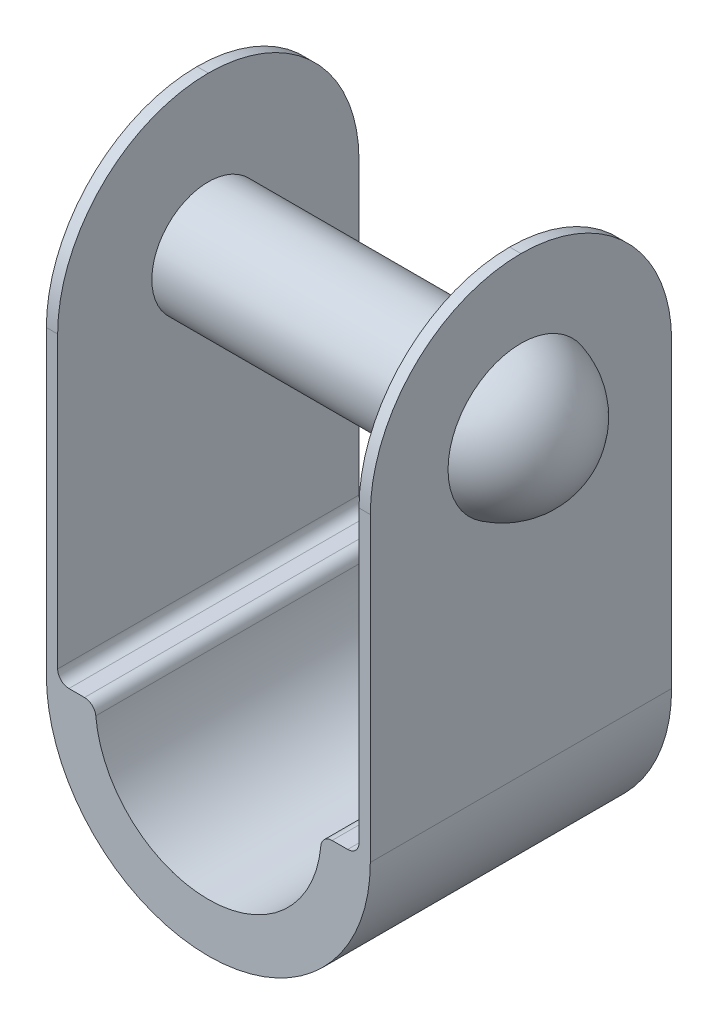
ISO-10303-21;
HEADER;
FILE_DESCRIPTION(('STEP AP214'),'2;1');
FILE_NAME('part.step','',(''),(''),'','','');
FILE_SCHEMA(('AUTOMOTIVE_DESIGN { 1 0 10303 214 1 1 1 1 }'));
ENDSEC;
DATA;
#1=APPLICATION_CONTEXT('core data for automotive mechanical design processes');
#2=APPLICATION_PROTOCOL_DEFINITION('international standard','automotive_design',2000,#1);
#3=PRODUCT_CONTEXT('',#1,'mechanical');
#4=PRODUCT('Part','Part','',(#3));
#5=PRODUCT_RELATED_PRODUCT_CATEGORY('part','',(#4));
#6=PRODUCT_DEFINITION_FORMATION('','',#4);
#7=PRODUCT_DEFINITION_CONTEXT('part definition',#1,'design');
#8=PRODUCT_DEFINITION('design','',#6,#7);
#9=PRODUCT_DEFINITION_SHAPE('','',#8);
#10=(LENGTH_UNIT() NAMED_UNIT(*) SI_UNIT(.MILLI.,.METRE.));
#11=(NAMED_UNIT(*) PLANE_ANGLE_UNIT() SI_UNIT($,.RADIAN.));
#12=(NAMED_UNIT(*) SI_UNIT($,.STERADIAN.) SOLID_ANGLE_UNIT());
#13=UNCERTAINTY_MEASURE_WITH_UNIT(LENGTH_MEASURE(1.E-05),#10,'distance_accuracy_value','');
#14=(GEOMETRIC_REPRESENTATION_CONTEXT(3) GLOBAL_UNCERTAINTY_ASSIGNED_CONTEXT((#13)) GLOBAL_UNIT_ASSIGNED_CONTEXT((#10,
#11,#12)) REPRESENTATION_CONTEXT('',''));
#15=CARTESIAN_POINT('',(0.,0.,0.));
#16=DIRECTION('',(0.,0.,1.));
#17=DIRECTION('',(1.,0.,0.));
#18=AXIS2_PLACEMENT_3D('',#15,#16,#17);
#19=CARTESIAN_POINT('',(-43.,0.,40.));
#20=DIRECTION('',(1.,0.,0.));
#21=DIRECTION('',(0.,0.,-1.));
#22=AXIS2_PLACEMENT_3D('',#19,#20,#21);
#23=PLANE('',#22);
#24=CARTESIAN_POINT('',(-43.,80.,0.));
#25=DIRECTION('',(1.,0.,0.));
#26=DIRECTION('',(0.,0.,-1.));
#27=AXIS2_PLACEMENT_3D('',#24,#25,#26);
#28=CIRCLE('',#27,40.);
#29=CARTESIAN_POINT('',(-43.,80.,40.));
#30=VERTEX_POINT('',#29);
#31=CARTESIAN_POINT('',(-43.,120.,0.));
#32=VERTEX_POINT('',#31);
#33=EDGE_CURVE('E169',#30,#32,#28,.F.);
#34=ORIENTED_EDGE('',*,*,#33,.T.);
#35=CARTESIAN_POINT('',(-43.,80.,0.));
#36=DIRECTION('',(1.,0.,0.));
#37=DIRECTION('',(0.,0.,-1.));
#38=AXIS2_PLACEMENT_3D('',#35,#36,#37);
#39=CIRCLE('',#38,40.);
#40=CARTESIAN_POINT('',(-43.,80.,-40.));
#41=VERTEX_POINT('',#40);
#42=EDGE_CURVE('E197',#32,#41,#39,.F.);
#43=ORIENTED_EDGE('',*,*,#42,.T.);
#44=DIRECTION('',(0.,-1.,0.));
#45=VECTOR('',#44,1.);
#46=CARTESIAN_POINT('',(-43.,0.,-40.));
#47=LINE('',#46,#45);
#48=CARTESIAN_POINT('',(-43.,0.,-40.));
#49=VERTEX_POINT('',#48);
#50=EDGE_CURVE('E166',#41,#49,#47,.T.);
#51=ORIENTED_EDGE('',*,*,#50,.T.);
#52=DIRECTION('',(0.,0.,-1.));
#53=VECTOR('',#52,1.);
#54=CARTESIAN_POINT('',(-43.,0.,40.));
#55=LINE('',#54,#53);
#56=CARTESIAN_POINT('',(-43.,0.,40.));
#57=VERTEX_POINT('',#56);
#58=EDGE_CURVE('E163',#57,#49,#55,.T.);
#59=ORIENTED_EDGE('',*,*,#58,.F.);
#60=DIRECTION('',(0.,-1.,0.));
#61=VECTOR('',#60,1.);
#62=CARTESIAN_POINT('',(-43.,0.,40.));
#63=LINE('',#62,#61);
#64=EDGE_CURVE('E148',#30,#57,#63,.T.);
#65=ORIENTED_EDGE('',*,*,#64,.F.);
#66=EDGE_LOOP('',(#34,#43,#51,#59,#65));
#67=FACE_BOUND('',#66,.T.);
#68=CARTESIAN_POINT('',(-43.,80.,0.));
#69=DIRECTION('',(1.,0.,0.));
#70=DIRECTION('',(0.,0.,-1.));
#71=AXIS2_PLACEMENT_3D('',#68,#69,#70);
#72=CIRCLE('',#71,19.3649167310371);
#73=CARTESIAN_POINT('',(-43.,80.,-19.3649167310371));
#74=VERTEX_POINT('',#73);
#75=EDGE_CURVE('E11',#74,#74,#72,.F.);
#76=ORIENTED_EDGE('',*,*,#75,.F.);
#77=EDGE_LOOP('',(#76));
#78=FACE_BOUND('',#77,.T.);
#79=ADVANCED_FACE('F35',(#67,#78),#23,.F.);
#80=CARTESIAN_POINT('',(43.,0.,40.));
#81=DIRECTION('',(-1.,0.,0.));
#82=DIRECTION('',(0.,0.,1.));
#83=AXIS2_PLACEMENT_3D('',#80,#81,#82);
#84=PLANE('',#83);
#85=DIRECTION('',(0.,1.,0.));
#86=VECTOR('',#85,1.);
#87=CARTESIAN_POINT('',(43.,0.,-40.));
#88=LINE('',#87,#86);
#89=CARTESIAN_POINT('',(43.,0.,-40.));
#90=VERTEX_POINT('',#89);
#91=CARTESIAN_POINT('',(43.,80.,-40.));
#92=VERTEX_POINT('',#91);
#93=EDGE_CURVE('E189',#90,#92,#88,.T.);
#94=ORIENTED_EDGE('',*,*,#93,.T.);
#95=CARTESIAN_POINT('',(43.,80.,0.));
#96=DIRECTION('',(-1.,0.,0.));
#97=DIRECTION('',(0.,0.,1.));
#98=AXIS2_PLACEMENT_3D('',#95,#96,#97);
#99=CIRCLE('',#98,40.);
#100=CARTESIAN_POINT('',(43.,120.,0.));
#101=VERTEX_POINT('',#100);
#102=EDGE_CURVE('E216',#92,#101,#99,.F.);
#103=ORIENTED_EDGE('',*,*,#102,.T.);
#104=CARTESIAN_POINT('',(43.,80.,0.));
#105=DIRECTION('',(-1.,0.,0.));
#106=DIRECTION('',(0.,0.,1.));
#107=AXIS2_PLACEMENT_3D('',#104,#105,#106);
#108=CIRCLE('',#107,40.);
#109=CARTESIAN_POINT('',(43.,80.,40.));
#110=VERTEX_POINT('',#109);
#111=EDGE_CURVE('E214',#101,#110,#108,.F.);
#112=ORIENTED_EDGE('',*,*,#111,.T.);
#113=DIRECTION('',(0.,1.,0.));
#114=VECTOR('',#113,1.);
#115=CARTESIAN_POINT('',(43.,0.,40.));
#116=LINE('',#115,#114);
#117=CARTESIAN_POINT('',(43.,0.,40.));
#118=VERTEX_POINT('',#117);
#119=EDGE_CURVE('E175',#118,#110,#116,.T.);
#120=ORIENTED_EDGE('',*,*,#119,.F.);
#121=DIRECTION('',(0.,0.,-1.));
#122=VECTOR('',#121,1.);
#123=CARTESIAN_POINT('',(43.,0.,40.));
#124=LINE('',#123,#122);
#125=EDGE_CURVE('E170',#118,#90,#124,.T.);
#126=ORIENTED_EDGE('',*,*,#125,.T.);
#127=EDGE_LOOP('',(#94,#103,#112,#120,#126));
#128=FACE_BOUND('',#127,.T.);
#129=CARTESIAN_POINT('',(43.,80.,0.));
#130=DIRECTION('',(-1.,0.,0.));
#131=DIRECTION('',(0.,0.,1.));
#132=AXIS2_PLACEMENT_3D('',#129,#130,#131);
#133=CIRCLE('',#132,19.3649167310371);
#134=CARTESIAN_POINT('',(43.,80.,19.3649167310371));
#135=VERTEX_POINT('',#134);
#136=EDGE_CURVE('E43',#135,#135,#133,.F.);
#137=ORIENTED_EDGE('',*,*,#136,.F.);
#138=EDGE_LOOP('',(#137));
#139=FACE_BOUND('',#138,.T.);
#140=ADVANCED_FACE('F265',(#128,#139),#84,.F.);
#141=CARTESIAN_POINT('',(0.,0.,40.));
#142=DIRECTION('',(0.,0.,-1.));
#143=DIRECTION('',(-1.,0.,0.));
#144=AXIS2_PLACEMENT_3D('',#141,#142,#143);
#145=CYLINDRICAL_SURFACE('',#144,43.);
#146=CARTESIAN_POINT('',(0.,0.,-40.));
#147=DIRECTION('',(0.,0.,1.));
#148=DIRECTION('',(1.,0.,0.));
#149=AXIS2_PLACEMENT_3D('',#146,#147,#148);
#150=CIRCLE('',#149,43.);
#151=EDGE_CURVE('E186',#49,#90,#150,.T.);
#152=ORIENTED_EDGE('',*,*,#151,.T.);
#153=ORIENTED_EDGE('',*,*,#125,.F.);
#154=CARTESIAN_POINT('',(0.,0.,40.));
#155=DIRECTION('',(0.,0.,1.));
#156=DIRECTION('',(1.,0.,0.));
#157=AXIS2_PLACEMENT_3D('',#154,#155,#156);
#158=CIRCLE('',#157,43.);
#159=EDGE_CURVE('E154',#57,#118,#158,.T.);
#160=ORIENTED_EDGE('',*,*,#159,.F.);
#161=ORIENTED_EDGE('',*,*,#58,.T.);
#162=EDGE_LOOP('',(#152,#153,#160,#161));
#163=FACE_BOUND('',#162,.T.);
#164=ADVANCED_FACE('F172',(#163),#145,.T.);
#165=CARTESIAN_POINT('',(40.,120.,40.));
#166=DIRECTION('',(1.,0.,0.));
#167=DIRECTION('',(0.,1.,0.));
#168=AXIS2_PLACEMENT_3D('',#165,#166,#167);
#169=PLANE('',#168);
#170=CARTESIAN_POINT('',(40.,80.,0.));
#171=DIRECTION('',(1.,0.,0.));
#172=DIRECTION('',(0.,1.,0.));
#173=AXIS2_PLACEMENT_3D('',#170,#171,#172);
#174=CIRCLE('',#173,15.);
#175=CARTESIAN_POINT('',(40.,95.,0.));
#176=VERTEX_POINT('',#175);
#177=EDGE_CURVE('E322',#176,#176,#174,.F.);
#178=ORIENTED_EDGE('',*,*,#177,.F.);
#179=EDGE_LOOP('',(#178));
#180=FACE_BOUND('',#179,.T.);
#181=DIRECTION('',(0.,-1.,0.));
#182=VECTOR('',#181,1.);
#183=CARTESIAN_POINT('',(40.,120.,-40.));
#184=LINE('',#183,#182);
#185=CARTESIAN_POINT('',(40.,80.,-40.));
#186=VERTEX_POINT('',#185);
#187=CARTESIAN_POINT('',(40.,3.,-40.));
#188=VERTEX_POINT('',#187);
#189=EDGE_CURVE('E192',#186,#188,#184,.T.);
#190=ORIENTED_EDGE('',*,*,#189,.T.);
#191=DIRECTION('',(0.,0.,-1.));
#192=VECTOR('',#191,1.);
#193=CARTESIAN_POINT('',(40.,3.,40.));
#194=LINE('',#193,#192);
#195=CARTESIAN_POINT('',(40.,3.,40.));
#196=VERTEX_POINT('',#195);
#197=EDGE_CURVE('E252',#188,#196,#194,.F.);
#198=ORIENTED_EDGE('',*,*,#197,.T.);
#199=DIRECTION('',(0.,-1.,0.));
#200=VECTOR('',#199,1.);
#201=CARTESIAN_POINT('',(40.,120.,40.));
#202=LINE('',#201,#200);
#203=CARTESIAN_POINT('',(40.,80.,40.));
#204=VERTEX_POINT('',#203);
#205=EDGE_CURVE('E177',#204,#196,#202,.T.);
#206=ORIENTED_EDGE('',*,*,#205,.F.);
#207=CARTESIAN_POINT('',(40.,80.,0.));
#208=DIRECTION('',(1.,0.,0.));
#209=DIRECTION('',(0.,1.,0.));
#210=AXIS2_PLACEMENT_3D('',#207,#208,#209);
#211=CIRCLE('',#210,40.);
#212=CARTESIAN_POINT('',(40.,120.,0.));
#213=VERTEX_POINT('',#212);
#214=EDGE_CURVE('E210',#204,#213,#211,.F.);
#215=ORIENTED_EDGE('',*,*,#214,.T.);
#216=CARTESIAN_POINT('',(40.,80.,0.));
#217=DIRECTION('',(1.,0.,0.));
#218=DIRECTION('',(0.,1.,0.));
#219=AXIS2_PLACEMENT_3D('',#216,#217,#218);
#220=CIRCLE('',#219,40.);
#221=EDGE_CURVE('E212',#213,#186,#220,.F.);
#222=ORIENTED_EDGE('',*,*,#221,.T.);
#223=EDGE_LOOP('',(#190,#198,#206,#215,#222));
#224=FACE_BOUND('',#223,.T.);
#225=ADVANCED_FACE('F274',(#180,#224),#169,.F.);
#226=CARTESIAN_POINT('',(-40.,120.,40.));
#227=DIRECTION('',(-1.,0.,0.));
#228=DIRECTION('',(0.,-1.,0.));
#229=AXIS2_PLACEMENT_3D('',#226,#227,#228);
#230=PLANE('',#229);
#231=CARTESIAN_POINT('',(-40.,80.,0.));
#232=DIRECTION('',(-1.,0.,0.));
#233=DIRECTION('',(0.,-1.,0.));
#234=AXIS2_PLACEMENT_3D('',#231,#232,#233);
#235=CIRCLE('',#234,15.);
#236=CARTESIAN_POINT('',(-40.,65.,0.));
#237=VERTEX_POINT('',#236);
#238=EDGE_CURVE('E327',#237,#237,#235,.F.);
#239=ORIENTED_EDGE('',*,*,#238,.F.);
#240=EDGE_LOOP('',(#239));
#241=FACE_BOUND('',#240,.T.);
#242=DIRECTION('',(0.,1.,0.));
#243=VECTOR('',#242,1.);
#244=CARTESIAN_POINT('',(-40.,120.,40.));
#245=LINE('',#244,#243);
#246=CARTESIAN_POINT('',(-40.,3.,40.));
#247=VERTEX_POINT('',#246);
#248=CARTESIAN_POINT('',(-40.,80.,40.));
#249=VERTEX_POINT('',#248);
#250=EDGE_CURVE('E183',#247,#249,#245,.T.);
#251=ORIENTED_EDGE('',*,*,#250,.F.);
#252=DIRECTION('',(0.,0.,-1.));
#253=VECTOR('',#252,1.);
#254=CARTESIAN_POINT('',(-40.,3.,40.));
#255=LINE('',#254,#253);
#256=CARTESIAN_POINT('',(-40.,3.,-40.));
#257=VERTEX_POINT('',#256);
#258=EDGE_CURVE('E221',#247,#257,#255,.T.);
#259=ORIENTED_EDGE('',*,*,#258,.T.);
#260=DIRECTION('',(0.,1.,0.));
#261=VECTOR('',#260,1.);
#262=CARTESIAN_POINT('',(-40.,120.,-40.));
#263=LINE('',#262,#261);
#264=CARTESIAN_POINT('',(-40.,80.,-40.));
#265=VERTEX_POINT('',#264);
#266=EDGE_CURVE('E160',#257,#265,#263,.T.);
#267=ORIENTED_EDGE('',*,*,#266,.T.);
#268=CARTESIAN_POINT('',(-40.,80.,0.));
#269=DIRECTION('',(-1.,0.,0.));
#270=DIRECTION('',(0.,-1.,0.));
#271=AXIS2_PLACEMENT_3D('',#268,#269,#270);
#272=CIRCLE('',#271,40.);
#273=CARTESIAN_POINT('',(-40.,120.,0.));
#274=VERTEX_POINT('',#273);
#275=EDGE_CURVE('E208',#265,#274,#272,.F.);
#276=ORIENTED_EDGE('',*,*,#275,.T.);
#277=CARTESIAN_POINT('',(-40.,80.,0.));
#278=DIRECTION('',(-1.,0.,0.));
#279=DIRECTION('',(0.,-1.,0.));
#280=AXIS2_PLACEMENT_3D('',#277,#278,#279);
#281=CIRCLE('',#280,40.);
#282=EDGE_CURVE('E205',#274,#249,#281,.F.);
#283=ORIENTED_EDGE('',*,*,#282,.T.);
#284=EDGE_LOOP('',(#251,#259,#267,#276,#283));
#285=FACE_BOUND('',#284,.T.);
#286=ADVANCED_FACE('F347',(#241,#285),#230,.F.);
#287=CARTESIAN_POINT('',(0.,0.,40.));
#288=DIRECTION('',(0.,0.,1.));
#289=DIRECTION('',(1.,0.,0.));
#290=AXIS2_PLACEMENT_3D('',#287,#288,#289);
#291=PLANE('',#290);
#292=CARTESIAN_POINT('',(0.,0.,40.));
#293=DIRECTION('',(0.,0.,-1.));
#294=DIRECTION('',(1.,0.,0.));
#295=AXIS2_PLACEMENT_3D('',#292,#293,#294);
#296=CIRCLE('',#295,30.);
#297=CARTESIAN_POINT('',(29.8757758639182,-2.72727272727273,40.));
#298=VERTEX_POINT('',#297);
#299=CARTESIAN_POINT('',(-29.8757758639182,-2.72727272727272,40.));
#300=VERTEX_POINT('',#299);
#301=EDGE_CURVE('E321',#298,#300,#296,.T.);
#302=ORIENTED_EDGE('',*,*,#301,.T.);
#303=CARTESIAN_POINT('',(-32.86335345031,-3.,40.));
#304=DIRECTION('',(0.,0.,1.));
#305=DIRECTION('',(1.,0.,0.));
#306=AXIS2_PLACEMENT_3D('',#303,#304,#305);
#307=CIRCLE('',#306,3.);
#308=CARTESIAN_POINT('',(-32.86335345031,0.,40.));
#309=VERTEX_POINT('',#308);
#310=EDGE_CURVE('E241',#300,#309,#307,.T.);
#311=ORIENTED_EDGE('',*,*,#310,.T.);
#312=DIRECTION('',(-1.,0.,0.));
#313=VECTOR('',#312,1.);
#314=CARTESIAN_POINT('',(-30.,0.,40.));
#315=LINE('',#314,#313);
#316=CARTESIAN_POINT('',(-37.,0.,40.));
#317=VERTEX_POINT('',#316);
#318=EDGE_CURVE('E324',#309,#317,#315,.T.);
#319=ORIENTED_EDGE('',*,*,#318,.T.);
#320=CARTESIAN_POINT('',(-37.,3.,40.));
#321=DIRECTION('',(0.,0.,1.));
#322=DIRECTION('',(1.,0.,0.));
#323=AXIS2_PLACEMENT_3D('',#320,#321,#322);
#324=CIRCLE('',#323,3.);
#325=EDGE_CURVE('E256',#317,#247,#324,.F.);
#326=ORIENTED_EDGE('',*,*,#325,.T.);
#327=ORIENTED_EDGE('',*,*,#250,.T.);
#328=DIRECTION('',(-1.,0.,0.));
#329=VECTOR('',#328,1.);
#330=CARTESIAN_POINT('',(-43.,80.,40.));
#331=LINE('',#330,#329);
#332=EDGE_CURVE('E157',#249,#30,#331,.T.);
#333=ORIENTED_EDGE('',*,*,#332,.T.);
#334=ORIENTED_EDGE('',*,*,#64,.T.);
#335=ORIENTED_EDGE('',*,*,#159,.T.);
#336=ORIENTED_EDGE('',*,*,#119,.T.);
#337=DIRECTION('',(-1.,0.,0.));
#338=VECTOR('',#337,1.);
#339=CARTESIAN_POINT('',(40.,80.,40.));
#340=LINE('',#339,#338);
#341=EDGE_CURVE('E219',#110,#204,#340,.T.);
#342=ORIENTED_EDGE('',*,*,#341,.T.);
#343=ORIENTED_EDGE('',*,*,#205,.T.);
#344=CARTESIAN_POINT('',(37.,3.,40.));
#345=DIRECTION('',(0.,0.,1.));
#346=DIRECTION('',(1.,0.,0.));
#347=AXIS2_PLACEMENT_3D('',#344,#345,#346);
#348=CIRCLE('',#347,3.);
#349=CARTESIAN_POINT('',(37.,0.,40.));
#350=VERTEX_POINT('',#349);
#351=EDGE_CURVE('E259',#196,#350,#348,.F.);
#352=ORIENTED_EDGE('',*,*,#351,.T.);
#353=DIRECTION('',(-1.,0.,0.));
#354=VECTOR('',#353,1.);
#355=CARTESIAN_POINT('',(30.,0.,40.));
#356=LINE('',#355,#354);
#357=CARTESIAN_POINT('',(32.86335345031,0.,40.));
#358=VERTEX_POINT('',#357);
#359=EDGE_CURVE('E316',#350,#358,#356,.T.);
#360=ORIENTED_EDGE('',*,*,#359,.T.);
#361=CARTESIAN_POINT('',(32.86335345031,-3.,40.));
#362=DIRECTION('',(0.,0.,1.));
#363=DIRECTION('',(1.,0.,0.));
#364=AXIS2_PLACEMENT_3D('',#361,#362,#363);
#365=CIRCLE('',#364,3.);
#366=EDGE_CURVE('E239',#358,#298,#365,.T.);
#367=ORIENTED_EDGE('',*,*,#366,.T.);
#368=EDGE_LOOP('',(#302,#311,#319,#326,#327,#333,#334,#335,#336,#342,#343,#352,#360,#367));
#369=FACE_BOUND('',#368,.T.);
#370=ADVANCED_FACE('F151',(#369),#291,.T.);
#371=CARTESIAN_POINT('',(0.,0.,-40.));
#372=DIRECTION('',(0.,0.,1.));
#373=DIRECTION('',(1.,0.,0.));
#374=AXIS2_PLACEMENT_3D('',#371,#372,#373);
#375=PLANE('',#374);
#376=DIRECTION('',(1.,0.,0.));
#377=VECTOR('',#376,1.);
#378=CARTESIAN_POINT('',(-30.,0.,-40.));
#379=LINE('',#378,#377);
#380=CARTESIAN_POINT('',(-37.,0.,-40.));
#381=VERTEX_POINT('',#380);
#382=CARTESIAN_POINT('',(-32.86335345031,0.,-40.));
#383=VERTEX_POINT('',#382);
#384=EDGE_CURVE('E330',#381,#383,#379,.T.);
#385=ORIENTED_EDGE('',*,*,#384,.T.);
#386=CARTESIAN_POINT('',(-32.86335345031,-3.,-40.));
#387=DIRECTION('',(0.,0.,1.));
#388=DIRECTION('',(1.,0.,0.));
#389=AXIS2_PLACEMENT_3D('',#386,#387,#388);
#390=CIRCLE('',#389,3.);
#391=CARTESIAN_POINT('',(-29.8757758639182,-2.72727272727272,-40.));
#392=VERTEX_POINT('',#391);
#393=EDGE_CURVE('E245',#383,#392,#390,.F.);
#394=ORIENTED_EDGE('',*,*,#393,.T.);
#395=CARTESIAN_POINT('',(0.,0.,-40.));
#396=DIRECTION('',(0.,0.,1.));
#397=DIRECTION('',(1.,0.,0.));
#398=AXIS2_PLACEMENT_3D('',#395,#396,#397);
#399=CIRCLE('',#398,30.);
#400=CARTESIAN_POINT('',(29.8757758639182,-2.72727272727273,-40.));
#401=VERTEX_POINT('',#400);
#402=EDGE_CURVE('E334',#392,#401,#399,.T.);
#403=ORIENTED_EDGE('',*,*,#402,.T.);
#404=CARTESIAN_POINT('',(32.86335345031,-3.,-40.));
#405=DIRECTION('',(0.,0.,1.));
#406=DIRECTION('',(1.,0.,0.));
#407=AXIS2_PLACEMENT_3D('',#404,#405,#406);
#408=CIRCLE('',#407,3.);
#409=CARTESIAN_POINT('',(32.86335345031,0.,-40.));
#410=VERTEX_POINT('',#409);
#411=EDGE_CURVE('E243',#401,#410,#408,.F.);
#412=ORIENTED_EDGE('',*,*,#411,.T.);
#413=DIRECTION('',(1.,0.,0.));
#414=VECTOR('',#413,1.);
#415=CARTESIAN_POINT('',(30.,0.,-40.));
#416=LINE('',#415,#414);
#417=CARTESIAN_POINT('',(37.,0.,-40.));
#418=VERTEX_POINT('',#417);
#419=EDGE_CURVE('E227',#410,#418,#416,.T.);
#420=ORIENTED_EDGE('',*,*,#419,.T.);
#421=CARTESIAN_POINT('',(37.,3.,-40.));
#422=DIRECTION('',(0.,0.,1.));
#423=DIRECTION('',(1.,0.,0.));
#424=AXIS2_PLACEMENT_3D('',#421,#422,#423);
#425=CIRCLE('',#424,3.);
#426=EDGE_CURVE('E50',#418,#188,#425,.T.);
#427=ORIENTED_EDGE('',*,*,#426,.T.);
#428=ORIENTED_EDGE('',*,*,#189,.F.);
#429=DIRECTION('',(-1.,0.,0.));
#430=VECTOR('',#429,1.);
#431=CARTESIAN_POINT('',(0.,80.,-40.));
#432=LINE('',#431,#430);
#433=EDGE_CURVE('E199',#186,#92,#432,.F.);
#434=ORIENTED_EDGE('',*,*,#433,.T.);
#435=ORIENTED_EDGE('',*,*,#93,.F.);
#436=ORIENTED_EDGE('',*,*,#151,.F.);
#437=ORIENTED_EDGE('',*,*,#50,.F.);
#438=DIRECTION('',(-1.,0.,0.));
#439=VECTOR('',#438,1.);
#440=CARTESIAN_POINT('',(0.,80.,-40.));
#441=LINE('',#440,#439);
#442=EDGE_CURVE('E202',#41,#265,#441,.F.);
#443=ORIENTED_EDGE('',*,*,#442,.T.);
#444=ORIENTED_EDGE('',*,*,#266,.F.);
#445=CARTESIAN_POINT('',(-37.,3.,-40.));
#446=DIRECTION('',(0.,0.,1.));
#447=DIRECTION('',(1.,0.,0.));
#448=AXIS2_PLACEMENT_3D('',#445,#446,#447);
#449=CIRCLE('',#448,3.);
#450=EDGE_CURVE('E254',#257,#381,#449,.T.);
#451=ORIENTED_EDGE('',*,*,#450,.T.);
#452=EDGE_LOOP('',(#385,#394,#403,#412,#420,#427,#428,#434,#435,#436,#437,#443,#444,#451));
#453=FACE_BOUND('',#452,.T.);
#454=ADVANCED_FACE('F288',(#453),#375,.F.);
#455=CARTESIAN_POINT('',(0.,80.,0.));
#456=DIRECTION('',(1.,0.,0.));
#457=DIRECTION('',(0.,0.,-1.));
#458=AXIS2_PLACEMENT_3D('',#455,#456,#457);
#459=CYLINDRICAL_SURFACE('',#458,40.);
#460=ORIENTED_EDGE('',*,*,#332,.F.);
#461=ORIENTED_EDGE('',*,*,#282,.F.);
#462=DIRECTION('',(-1.,0.,0.));
#463=VECTOR('',#462,1.);
#464=CARTESIAN_POINT('',(-40.,120.,0.));
#465=LINE('',#464,#463);
#466=EDGE_CURVE('E187',#32,#274,#465,.F.);
#467=ORIENTED_EDGE('',*,*,#466,.F.);
#468=ORIENTED_EDGE('',*,*,#33,.F.);
#469=EDGE_LOOP('',(#460,#461,#467,#468));
#470=FACE_BOUND('',#469,.T.);
#471=ADVANCED_FACE('F284',(#470),#459,.T.);
#472=CARTESIAN_POINT('',(-43.,80.,0.));
#473=DIRECTION('',(-1.,0.,0.));
#474=DIRECTION('',(0.,0.,1.));
#475=AXIS2_PLACEMENT_3D('',#472,#473,#474);
#476=CYLINDRICAL_SURFACE('',#475,40.);
#477=ORIENTED_EDGE('',*,*,#275,.F.);
#478=ORIENTED_EDGE('',*,*,#442,.F.);
#479=ORIENTED_EDGE('',*,*,#42,.F.);
#480=ORIENTED_EDGE('',*,*,#466,.T.);
#481=EDGE_LOOP('',(#477,#478,#479,#480));
#482=FACE_BOUND('',#481,.T.);
#483=ADVANCED_FACE('F280',(#482),#476,.T.);
#484=CARTESIAN_POINT('',(0.,80.,0.));
#485=DIRECTION('',(1.,0.,0.));
#486=DIRECTION('',(0.,0.,-1.));
#487=AXIS2_PLACEMENT_3D('',#484,#485,#486);
#488=CYLINDRICAL_SURFACE('',#487,40.);
#489=ORIENTED_EDGE('',*,*,#341,.F.);
#490=ORIENTED_EDGE('',*,*,#111,.F.);
#491=DIRECTION('',(-1.,0.,0.));
#492=VECTOR('',#491,1.);
#493=CARTESIAN_POINT('',(43.,120.,0.));
#494=LINE('',#493,#492);
#495=EDGE_CURVE('E224',#213,#101,#494,.F.);
#496=ORIENTED_EDGE('',*,*,#495,.F.);
#497=ORIENTED_EDGE('',*,*,#214,.F.);
#498=EDGE_LOOP('',(#489,#490,#496,#497));
#499=FACE_BOUND('',#498,.T.);
#500=ADVANCED_FACE('F283',(#499),#488,.T.);
#501=CARTESIAN_POINT('',(40.,80.,0.));
#502=DIRECTION('',(-1.,0.,0.));
#503=DIRECTION('',(0.,0.,1.));
#504=AXIS2_PLACEMENT_3D('',#501,#502,#503);
#505=CYLINDRICAL_SURFACE('',#504,40.);
#506=ORIENTED_EDGE('',*,*,#102,.F.);
#507=ORIENTED_EDGE('',*,*,#433,.F.);
#508=ORIENTED_EDGE('',*,*,#221,.F.);
#509=ORIENTED_EDGE('',*,*,#495,.T.);
#510=EDGE_LOOP('',(#506,#507,#508,#509));
#511=FACE_BOUND('',#510,.T.);
#512=ADVANCED_FACE('F290',(#511),#505,.T.);
#513=CARTESIAN_POINT('',(-30.,0.,-129.442719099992));
#514=DIRECTION('',(0.,1.,0.));
#515=DIRECTION('',(-1.,0.,0.));
#516=AXIS2_PLACEMENT_3D('',#513,#514,#515);
#517=PLANE('',#516);
#518=ORIENTED_EDGE('',*,*,#384,.F.);
#519=DIRECTION('',(0.,0.,-1.));
#520=VECTOR('',#519,1.);
#521=CARTESIAN_POINT('',(-37.,0.,-129.442719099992));
#522=LINE('',#521,#520);
#523=EDGE_CURVE('E232',#381,#317,#522,.F.);
#524=ORIENTED_EDGE('',*,*,#523,.T.);
#525=ORIENTED_EDGE('',*,*,#318,.F.);
#526=DIRECTION('',(0.,0.,1.));
#527=VECTOR('',#526,1.);
#528=CARTESIAN_POINT('',(-32.86335345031,0.,-129.442719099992));
#529=LINE('',#528,#527);
#530=EDGE_CURVE('E230',#309,#383,#529,.F.);
#531=ORIENTED_EDGE('',*,*,#530,.T.);
#532=EDGE_LOOP('',(#518,#524,#525,#531));
#533=FACE_BOUND('',#532,.T.);
#534=ADVANCED_FACE('F293',(#533),#517,.T.);
#535=CARTESIAN_POINT('',(0.,0.,-129.442719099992));
#536=DIRECTION('',(0.,0.,1.));
#537=DIRECTION('',(1.,0.,0.));
#538=AXIS2_PLACEMENT_3D('',#535,#536,#537);
#539=CYLINDRICAL_SURFACE('',#538,30.);
#540=ORIENTED_EDGE('',*,*,#402,.F.);
#541=DIRECTION('',(0.,0.,1.));
#542=VECTOR('',#541,1.);
#543=CARTESIAN_POINT('',(-29.8757758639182,-2.72727272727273,-129.442719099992));
#544=LINE('',#543,#542);
#545=EDGE_CURVE('E236',#392,#300,#544,.T.);
#546=ORIENTED_EDGE('',*,*,#545,.T.);
#547=ORIENTED_EDGE('',*,*,#301,.F.);
#548=DIRECTION('',(0.,0.,1.));
#549=VECTOR('',#548,1.);
#550=CARTESIAN_POINT('',(29.8757758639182,-2.72727272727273,-129.442719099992));
#551=LINE('',#550,#549);
#552=EDGE_CURVE('E234',#298,#401,#551,.F.);
#553=ORIENTED_EDGE('',*,*,#552,.T.);
#554=EDGE_LOOP('',(#540,#546,#547,#553));
#555=FACE_BOUND('',#554,.T.);
#556=ADVANCED_FACE('F361',(#555),#539,.F.);
#557=CARTESIAN_POINT('',(30.,0.,-129.442719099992));
#558=DIRECTION('',(0.,1.,0.));
#559=DIRECTION('',(0.,0.,1.));
#560=AXIS2_PLACEMENT_3D('',#557,#558,#559);
#561=PLANE('',#560);
#562=ORIENTED_EDGE('',*,*,#359,.F.);
#563=DIRECTION('',(0.,0.,-1.));
#564=VECTOR('',#563,1.);
#565=CARTESIAN_POINT('',(37.,0.,-129.442719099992));
#566=LINE('',#565,#564);
#567=EDGE_CURVE('E250',#350,#418,#566,.T.);
#568=ORIENTED_EDGE('',*,*,#567,.T.);
#569=ORIENTED_EDGE('',*,*,#419,.F.);
#570=DIRECTION('',(0.,0.,1.));
#571=VECTOR('',#570,1.);
#572=CARTESIAN_POINT('',(32.86335345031,0.,-129.442719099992));
#573=LINE('',#572,#571);
#574=EDGE_CURVE('E247',#410,#358,#573,.T.);
#575=ORIENTED_EDGE('',*,*,#574,.T.);
#576=EDGE_LOOP('',(#562,#568,#569,#575));
#577=FACE_BOUND('',#576,.T.);
#578=ADVANCED_FACE('F302',(#577),#561,.T.);
#579=CARTESIAN_POINT('',(-37.,3.,40.));
#580=DIRECTION('',(0.,0.,-1.));
#581=DIRECTION('',(-1.,0.,0.));
#582=AXIS2_PLACEMENT_3D('',#579,#580,#581);
#583=CYLINDRICAL_SURFACE('',#582,3.);
#584=ORIENTED_EDGE('',*,*,#325,.F.);
#585=ORIENTED_EDGE('',*,*,#523,.F.);
#586=ORIENTED_EDGE('',*,*,#450,.F.);
#587=ORIENTED_EDGE('',*,*,#258,.F.);
#588=EDGE_LOOP('',(#584,#585,#586,#587));
#589=FACE_BOUND('',#588,.T.);
#590=ADVANCED_FACE('F298',(#589),#583,.F.);
#591=CARTESIAN_POINT('',(-32.86335345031,-3.,-129.442719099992));
#592=DIRECTION('',(0.,0.,1.));
#593=DIRECTION('',(1.,0.,0.));
#594=AXIS2_PLACEMENT_3D('',#591,#592,#593);
#595=CYLINDRICAL_SURFACE('',#594,3.);
#596=ORIENTED_EDGE('',*,*,#393,.F.);
#597=ORIENTED_EDGE('',*,*,#530,.F.);
#598=ORIENTED_EDGE('',*,*,#310,.F.);
#599=ORIENTED_EDGE('',*,*,#545,.F.);
#600=EDGE_LOOP('',(#596,#597,#598,#599));
#601=FACE_BOUND('',#600,.T.);
#602=ADVANCED_FACE('F301',(#601),#595,.T.);
#603=CARTESIAN_POINT('',(37.,3.,-129.442719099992));
#604=DIRECTION('',(0.,0.,-1.));
#605=DIRECTION('',(-1.,0.,0.));
#606=AXIS2_PLACEMENT_3D('',#603,#604,#605);
#607=CYLINDRICAL_SURFACE('',#606,3.);
#608=ORIENTED_EDGE('',*,*,#351,.F.);
#609=ORIENTED_EDGE('',*,*,#197,.F.);
#610=ORIENTED_EDGE('',*,*,#426,.F.);
#611=ORIENTED_EDGE('',*,*,#567,.F.);
#612=EDGE_LOOP('',(#608,#609,#610,#611));
#613=FACE_BOUND('',#612,.T.);
#614=ADVANCED_FACE('F305',(#613),#607,.F.);
#615=CARTESIAN_POINT('',(32.86335345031,-3.,-129.442719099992));
#616=DIRECTION('',(0.,0.,1.));
#617=DIRECTION('',(1.,0.,0.));
#618=AXIS2_PLACEMENT_3D('',#615,#616,#617);
#619=CYLINDRICAL_SURFACE('',#618,3.);
#620=ORIENTED_EDGE('',*,*,#411,.F.);
#621=ORIENTED_EDGE('',*,*,#552,.F.);
#622=ORIENTED_EDGE('',*,*,#366,.F.);
#623=ORIENTED_EDGE('',*,*,#574,.F.);
#624=EDGE_LOOP('',(#620,#621,#622,#623));
#625=FACE_BOUND('',#624,.T.);
#626=ADVANCED_FACE('F37',(#625),#619,.T.);
#627=CARTESIAN_POINT('',(-79.9429928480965,80.,0.));
#628=DIRECTION('',(-1.,0.,0.));
#629=DIRECTION('',(0.,0.,1.));
#630=AXIS2_PLACEMENT_3D('',#627,#628,#629);
#631=CYLINDRICAL_SURFACE('',#630,15.);
#632=ORIENTED_EDGE('',*,*,#238,.T.);
#633=EDGE_LOOP('',(#632));
#634=FACE_BOUND('',#633,.T.);
#635=ORIENTED_EDGE('',*,*,#177,.T.);
#636=EDGE_LOOP('',(#635));
#637=FACE_BOUND('',#636,.T.);
#638=ADVANCED_FACE('F311',(#634,#637),#631,.T.);
#639=CARTESIAN_POINT('',(38.,80.,0.));
#640=DIRECTION('',(-1.,0.,0.));
#641=DIRECTION('',(0.,1.,0.));
#642=AXIS2_PLACEMENT_3D('',#639,#640,#641);
#643=SPHERICAL_SURFACE('',#642,20.);
#644=ORIENTED_EDGE('',*,*,#136,.T.);
#645=EDGE_LOOP('',(#644));
#646=FACE_BOUND('',#645,.T.);
#647=ADVANCED_FACE('F263',(#646),#643,.T.);
#648=CARTESIAN_POINT('',(-38.,80.,0.));
#649=DIRECTION('',(-1.,0.,0.));
#650=DIRECTION('',(0.,1.,0.));
#651=AXIS2_PLACEMENT_3D('',#648,#649,#650);
#652=SPHERICAL_SURFACE('',#651,20.);
#653=ORIENTED_EDGE('',*,*,#75,.T.);
#654=EDGE_LOOP('',(#653));
#655=FACE_BOUND('',#654,.T.);
#656=ADVANCED_FACE('F459',(#655),#652,.T.);
#657=CLOSED_SHELL('',(#79,#140,#164,#225,#286,#370,#454,#471,#483,#500,#512,#534,#556,#578,#590,
#602,#614,#626,#638,#647,#656));
#658=MANIFOLD_SOLID_BREP('B2',#657);
#659=ADVANCED_BREP_SHAPE_REPRESENTATION('',(#18,#658),#14);
#660=SHAPE_DEFINITION_REPRESENTATION(#9,#659);
ENDSEC;
END-ISO-10303-21;
